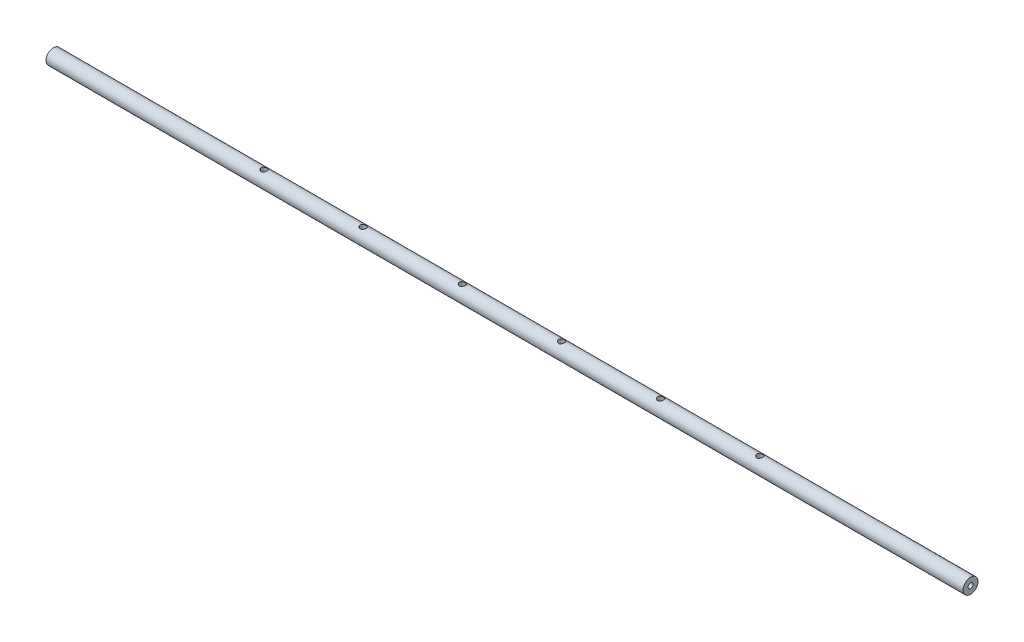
from build123d import *

# Parameters (mm, degrees)
ESQUISSE2_R                = 7.5
EXTRUSION1_DEPTH           = 462.5
TROU_TARAUD_M6X1_01_D      = 5
TROU_TARAUD_M6X1_01_DEPTH  = 23
TROU_TARAUD_M6X1_01_TIP    = 1.502151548
TROU_TARAUD_M6X1_02_D      = 5
TROU_TARAUD_M6X1_02_DEPTH  = 23
TROU_TARAUD_M6X1_02_TIP    = 1.502151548
ESQUISSE7_R                = 3
ENL_V_MAT_EXTRU_1_DEPTH    = 10
R_P_TITION_LIN_AIRE1_COUNT = 6
R_P_TITION_LIN_AIRE1_PITCH = 100


with BuildPart() as part:
    # Esquisse2 → Extrusion1 (new, symmetric)
    with BuildSketch(Plane(origin=(0, 0, 0), x_dir=(0, 0, -1), z_dir=(1, 0, 0))):
        with Locations(Location((0, 0, 0), (0, 0, 180))):
            Circle(ESQUISSE2_R)
    extrude(amount=EXTRUSION1_DEPTH, both=True)

    # Trou taraud_ M6x1.01
    with Locations(Plane.ZY.offset(462.5)):
        with Locations((0, 0)):
            Hole(TROU_TARAUD_M6X1_01_D / 2, depth=TROU_TARAUD_M6X1_01_DEPTH)
            with Locations((0, 0, -(TROU_TARAUD_M6X1_01_DEPTH + TROU_TARAUD_M6X1_01_TIP / 2))):  # 118° drill point
                Cone(0, TROU_TARAUD_M6X1_01_D / 2, TROU_TARAUD_M6X1_01_TIP, mode=Mode.SUBTRACT)

    # Trou taraud_ M6x1.02
    with Locations(Plane(origin=(462.5, 0, 0), x_dir=(0, 0, -1), z_dir=(1, 0, 0))):
        with Locations((0, 0)):
            Hole(TROU_TARAUD_M6X1_02_D / 2, depth=TROU_TARAUD_M6X1_02_DEPTH)
            with Locations((0, 0, -(TROU_TARAUD_M6X1_02_DEPTH + TROU_TARAUD_M6X1_02_TIP / 2))):  # 118° drill point
                Cone(0, TROU_TARAUD_M6X1_02_D / 2, TROU_TARAUD_M6X1_02_TIP, mode=Mode.SUBTRACT)

    # Esquisse7 → Enl_v. mat.-Extru.1 (cut, symmetric)
    with BuildSketch(Plane(origin=(0, 0, 0), x_dir=(1, 0, 0), z_dir=(0, 1, 0))):
        with Locations(Location((-250, 0, 0), (0, 0, 270))):
            Circle(ESQUISSE7_R)
    enl_v_mat_extru_1 = extrude(amount=ENL_V_MAT_EXTRU_1_DEPTH, both=True, mode=Mode.SUBTRACT)

    # R_p_tition lin_aire1: Enl_v. mat.-Extru.1 ×6
    with Locations(*[(i * R_P_TITION_LIN_AIRE1_PITCH, 0, 0) for i in range(1, R_P_TITION_LIN_AIRE1_COUNT)]):
        add(enl_v_mat_extru_1, mode=Mode.SUBTRACT)


solid = part.part
